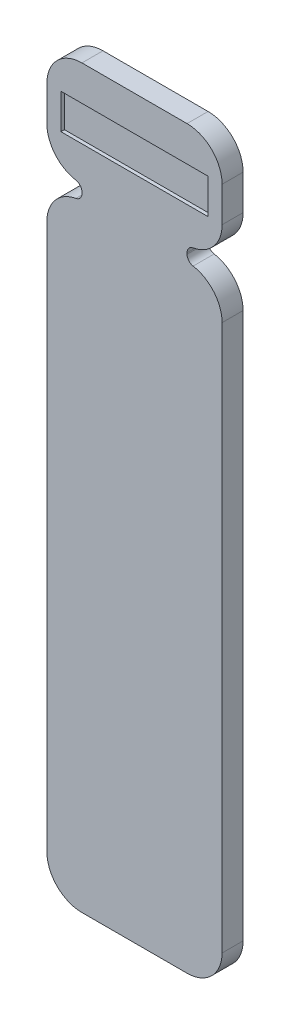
ISO-10303-21;
HEADER;
FILE_DESCRIPTION(('STEP AP214'),'2;1');
FILE_NAME('part.step','',(''),(''),'','','');
FILE_SCHEMA(('AUTOMOTIVE_DESIGN { 1 0 10303 214 1 1 1 1 }'));
ENDSEC;
DATA;
#1=APPLICATION_CONTEXT('core data for automotive mechanical design processes');
#2=APPLICATION_PROTOCOL_DEFINITION('international standard','automotive_design',2000,#1);
#3=PRODUCT_CONTEXT('',#1,'mechanical');
#4=PRODUCT('Part','Part','',(#3));
#5=PRODUCT_RELATED_PRODUCT_CATEGORY('part','',(#4));
#6=PRODUCT_DEFINITION_FORMATION('','',#4);
#7=PRODUCT_DEFINITION_CONTEXT('part definition',#1,'design');
#8=PRODUCT_DEFINITION('design','',#6,#7);
#9=PRODUCT_DEFINITION_SHAPE('','',#8);
#10=(LENGTH_UNIT() NAMED_UNIT(*) SI_UNIT(.MILLI.,.METRE.));
#11=(NAMED_UNIT(*) PLANE_ANGLE_UNIT() SI_UNIT($,.RADIAN.));
#12=(NAMED_UNIT(*) SI_UNIT($,.STERADIAN.) SOLID_ANGLE_UNIT());
#13=UNCERTAINTY_MEASURE_WITH_UNIT(LENGTH_MEASURE(1.E-05),#10,'distance_accuracy_value','');
#14=(GEOMETRIC_REPRESENTATION_CONTEXT(3) GLOBAL_UNCERTAINTY_ASSIGNED_CONTEXT((#13)) GLOBAL_UNIT_ASSIGNED_CONTEXT((#10,
#11,#12)) REPRESENTATION_CONTEXT('',''));
#15=CARTESIAN_POINT('',(0.,0.,0.));
#16=DIRECTION('',(0.,0.,1.));
#17=DIRECTION('',(1.,0.,0.));
#18=AXIS2_PLACEMENT_3D('',#15,#16,#17);
#19=CARTESIAN_POINT('',(-50.,35.,3.));
#20=DIRECTION('',(0.,-1.,0.));
#21=DIRECTION('',(1.,0.,0.));
#22=AXIS2_PLACEMENT_3D('',#19,#20,#21);
#23=PLANE('',#22);
#24=DIRECTION('',(-1.,0.,0.));
#25=VECTOR('',#24,1.);
#26=CARTESIAN_POINT('',(-50.,35.,3.));
#27=LINE('',#26,#25);
#28=CARTESIAN_POINT('',(-30.,35.,3.));
#29=VERTEX_POINT('',#28);
#30=CARTESIAN_POINT('',(-45.,35.,3.));
#31=VERTEX_POINT('',#30);
#32=EDGE_CURVE('E248',#29,#31,#27,.T.);
#33=ORIENTED_EDGE('',*,*,#32,.F.);
#34=DIRECTION('',(0.,0.,-1.));
#35=VECTOR('',#34,1.);
#36=CARTESIAN_POINT('',(-30.,35.,3.));
#37=LINE('',#36,#35);
#38=CARTESIAN_POINT('',(-30.,35.,0.));
#39=VERTEX_POINT('',#38);
#40=EDGE_CURVE('E341',#29,#39,#37,.T.);
#41=ORIENTED_EDGE('',*,*,#40,.T.);
#42=DIRECTION('',(-1.,0.,0.));
#43=VECTOR('',#42,1.);
#44=CARTESIAN_POINT('',(-50.,35.,0.));
#45=LINE('',#44,#43);
#46=CARTESIAN_POINT('',(-45.,35.,0.));
#47=VERTEX_POINT('',#46);
#48=EDGE_CURVE('E224',#39,#47,#45,.T.);
#49=ORIENTED_EDGE('',*,*,#48,.T.);
#50=DIRECTION('',(0.,0.,-1.));
#51=VECTOR('',#50,1.);
#52=CARTESIAN_POINT('',(-45.,35.,3.));
#53=LINE('',#52,#51);
#54=EDGE_CURVE('E339',#47,#31,#53,.F.);
#55=ORIENTED_EDGE('',*,*,#54,.T.);
#56=EDGE_LOOP('',(#33,#41,#49,#55));
#57=FACE_BOUND('',#56,.T.);
#58=ADVANCED_FACE('F26',(#57),#23,.F.);
#59=CARTESIAN_POINT('',(-50.,35.,3.));
#60=DIRECTION('',(1.,0.,0.));
#61=DIRECTION('',(0.,1.,0.));
#62=AXIS2_PLACEMENT_3D('',#59,#60,#61);
#63=PLANE('',#62);
#64=DIRECTION('',(0.,-1.,0.));
#65=VECTOR('',#64,1.);
#66=CARTESIAN_POINT('',(-50.,35.,3.));
#67=LINE('',#66,#65);
#68=CARTESIAN_POINT('',(-50.,30.,3.));
#69=VERTEX_POINT('',#68);
#70=CARTESIAN_POINT('',(-50.,25.,3.));
#71=VERTEX_POINT('',#70);
#72=EDGE_CURVE('E251',#69,#71,#67,.T.);
#73=ORIENTED_EDGE('',*,*,#72,.F.);
#74=DIRECTION('',(0.,0.,-1.));
#75=VECTOR('',#74,1.);
#76=CARTESIAN_POINT('',(-50.,30.,3.));
#77=LINE('',#76,#75);
#78=CARTESIAN_POINT('',(-50.,30.,0.));
#79=VERTEX_POINT('',#78);
#80=EDGE_CURVE('E11',#69,#79,#77,.T.);
#81=ORIENTED_EDGE('',*,*,#80,.T.);
#82=DIRECTION('',(0.,-1.,0.));
#83=VECTOR('',#82,1.);
#84=CARTESIAN_POINT('',(-50.,35.,0.));
#85=LINE('',#84,#83);
#86=CARTESIAN_POINT('',(-50.,25.,0.));
#87=VERTEX_POINT('',#86);
#88=EDGE_CURVE('E229',#79,#87,#85,.T.);
#89=ORIENTED_EDGE('',*,*,#88,.T.);
#90=DIRECTION('',(0.,0.,-1.));
#91=VECTOR('',#90,1.);
#92=CARTESIAN_POINT('',(-50.,25.,3.));
#93=LINE('',#92,#91);
#94=EDGE_CURVE('E300',#87,#71,#93,.F.);
#95=ORIENTED_EDGE('',*,*,#94,.T.);
#96=EDGE_LOOP('',(#73,#81,#89,#95));
#97=FACE_BOUND('',#96,.T.);
#98=ADVANCED_FACE('F418',(#97),#63,.F.);
#99=CARTESIAN_POINT('',(-45.,20.,3.));
#100=DIRECTION('',(1.,0.,0.));
#101=DIRECTION('',(0.,0.,-1.));
#102=AXIS2_PLACEMENT_3D('',#99,#100,#101);
#103=PLANE('',#102);
#104=DIRECTION('',(0.,-1.,0.));
#105=VECTOR('',#104,1.);
#106=CARTESIAN_POINT('',(-45.,20.,0.));
#107=LINE('',#106,#105);
#108=CARTESIAN_POINT('',(-45.,19.0418123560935,0.));
#109=VERTEX_POINT('',#108);
#110=CARTESIAN_POINT('',(-45.,18.8581876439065,0.));
#111=VERTEX_POINT('',#110);
#112=EDGE_CURVE('E231',#109,#111,#107,.T.);
#113=ORIENTED_EDGE('',*,*,#112,.T.);
#114=DIRECTION('',(0.,0.,-1.));
#115=VECTOR('',#114,1.);
#116=CARTESIAN_POINT('',(-45.,18.8581876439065,3.));
#117=LINE('',#116,#115);
#118=CARTESIAN_POINT('',(-45.,18.8581876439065,3.));
#119=VERTEX_POINT('',#118);
#120=EDGE_CURVE('E319',#111,#119,#117,.F.);
#121=ORIENTED_EDGE('',*,*,#120,.T.);
#122=DIRECTION('',(0.,-1.,0.));
#123=VECTOR('',#122,1.);
#124=CARTESIAN_POINT('',(-45.,20.,3.));
#125=LINE('',#124,#123);
#126=CARTESIAN_POINT('',(-45.,19.0418123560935,3.));
#127=VERTEX_POINT('',#126);
#128=EDGE_CURVE('E253',#127,#119,#125,.T.);
#129=ORIENTED_EDGE('',*,*,#128,.F.);
#130=DIRECTION('',(0.,0.,-1.));
#131=VECTOR('',#130,1.);
#132=CARTESIAN_POINT('',(-45.,19.0418123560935,3.));
#133=LINE('',#132,#131);
#134=EDGE_CURVE('E316',#127,#109,#133,.T.);
#135=ORIENTED_EDGE('',*,*,#134,.T.);
#136=EDGE_LOOP('',(#113,#121,#129,#135));
#137=FACE_BOUND('',#136,.T.);
#138=ADVANCED_FACE('F433',(#137),#103,.F.);
#139=CARTESIAN_POINT('',(-50.,17.9,3.));
#140=DIRECTION('',(1.,0.,0.));
#141=DIRECTION('',(0.,1.,0.));
#142=AXIS2_PLACEMENT_3D('',#139,#140,#141);
#143=PLANE('',#142);
#144=DIRECTION('',(0.,-1.,0.));
#145=VECTOR('',#144,1.);
#146=CARTESIAN_POINT('',(-50.,17.9,0.));
#147=LINE('',#146,#145);
#148=CARTESIAN_POINT('',(-50.,12.9,0.));
#149=VERTEX_POINT('',#148);
#150=CARTESIAN_POINT('',(-50.,-65.,0.));
#151=VERTEX_POINT('',#150);
#152=EDGE_CURVE('E234',#149,#151,#147,.T.);
#153=ORIENTED_EDGE('',*,*,#152,.T.);
#154=DIRECTION('',(0.,0.,-1.));
#155=VECTOR('',#154,1.);
#156=CARTESIAN_POINT('',(-50.,-65.,3.));
#157=LINE('',#156,#155);
#158=CARTESIAN_POINT('',(-50.,-65.,3.));
#159=VERTEX_POINT('',#158);
#160=EDGE_CURVE('E366',#151,#159,#157,.F.);
#161=ORIENTED_EDGE('',*,*,#160,.T.);
#162=DIRECTION('',(0.,-1.,0.));
#163=VECTOR('',#162,1.);
#164=CARTESIAN_POINT('',(-50.,17.9,3.));
#165=LINE('',#164,#163);
#166=CARTESIAN_POINT('',(-50.,12.9,3.));
#167=VERTEX_POINT('',#166);
#168=EDGE_CURVE('E256',#167,#159,#165,.T.);
#169=ORIENTED_EDGE('',*,*,#168,.F.);
#170=DIRECTION('',(0.,0.,-1.));
#171=VECTOR('',#170,1.);
#172=CARTESIAN_POINT('',(-50.,12.9,3.));
#173=LINE('',#172,#171);
#174=EDGE_CURVE('E297',#167,#149,#173,.T.);
#175=ORIENTED_EDGE('',*,*,#174,.T.);
#176=EDGE_LOOP('',(#153,#161,#169,#175));
#177=FACE_BOUND('',#176,.T.);
#178=ADVANCED_FACE('F447',(#177),#143,.F.);
#179=CARTESIAN_POINT('',(-50.,-70.,3.));
#180=DIRECTION('',(0.,1.,0.));
#181=DIRECTION('',(0.,0.,1.));
#182=AXIS2_PLACEMENT_3D('',#179,#180,#181);
#183=PLANE('',#182);
#184=DIRECTION('',(1.,0.,0.));
#185=VECTOR('',#184,1.);
#186=CARTESIAN_POINT('',(-50.,-70.,3.));
#187=LINE('',#186,#185);
#188=CARTESIAN_POINT('',(-45.,-70.,3.));
#189=VERTEX_POINT('',#188);
#190=CARTESIAN_POINT('',(-30.,-70.,3.));
#191=VERTEX_POINT('',#190);
#192=EDGE_CURVE('E259',#189,#191,#187,.T.);
#193=ORIENTED_EDGE('',*,*,#192,.F.);
#194=DIRECTION('',(0.,0.,-1.));
#195=VECTOR('',#194,1.);
#196=CARTESIAN_POINT('',(-45.,-70.,3.));
#197=LINE('',#196,#195);
#198=CARTESIAN_POINT('',(-45.,-70.,0.));
#199=VERTEX_POINT('',#198);
#200=EDGE_CURVE('E363',#189,#199,#197,.T.);
#201=ORIENTED_EDGE('',*,*,#200,.T.);
#202=DIRECTION('',(1.,0.,0.));
#203=VECTOR('',#202,1.);
#204=CARTESIAN_POINT('',(-50.,-70.,0.));
#205=LINE('',#204,#203);
#206=CARTESIAN_POINT('',(-30.,-70.,0.));
#207=VERTEX_POINT('',#206);
#208=EDGE_CURVE('E237',#199,#207,#205,.T.);
#209=ORIENTED_EDGE('',*,*,#208,.T.);
#210=DIRECTION('',(0.,0.,-1.));
#211=VECTOR('',#210,1.);
#212=CARTESIAN_POINT('',(-30.,-70.,3.));
#213=LINE('',#212,#211);
#214=EDGE_CURVE('E361',#207,#191,#213,.F.);
#215=ORIENTED_EDGE('',*,*,#214,.T.);
#216=EDGE_LOOP('',(#193,#201,#209,#215));
#217=FACE_BOUND('',#216,.T.);
#218=ADVANCED_FACE('F454',(#217),#183,.F.);
#219=CARTESIAN_POINT('',(-25.,17.9,3.));
#220=DIRECTION('',(-1.,0.,0.));
#221=DIRECTION('',(0.,-1.,0.));
#222=AXIS2_PLACEMENT_3D('',#219,#220,#221);
#223=PLANE('',#222);
#224=DIRECTION('',(0.,1.,0.));
#225=VECTOR('',#224,1.);
#226=CARTESIAN_POINT('',(-25.,17.9,3.));
#227=LINE('',#226,#225);
#228=CARTESIAN_POINT('',(-25.,-65.,3.));
#229=VERTEX_POINT('',#228);
#230=CARTESIAN_POINT('',(-25.,12.9,3.));
#231=VERTEX_POINT('',#230);
#232=EDGE_CURVE('E261',#229,#231,#227,.T.);
#233=ORIENTED_EDGE('',*,*,#232,.F.);
#234=DIRECTION('',(0.,0.,-1.));
#235=VECTOR('',#234,1.);
#236=CARTESIAN_POINT('',(-25.,-65.,3.));
#237=LINE('',#236,#235);
#238=CARTESIAN_POINT('',(-25.,-65.,0.));
#239=VERTEX_POINT('',#238);
#240=EDGE_CURVE('E33',#229,#239,#237,.T.);
#241=ORIENTED_EDGE('',*,*,#240,.T.);
#242=DIRECTION('',(0.,1.,0.));
#243=VECTOR('',#242,1.);
#244=CARTESIAN_POINT('',(-25.,17.9,0.));
#245=LINE('',#244,#243);
#246=CARTESIAN_POINT('',(-25.,12.9,0.));
#247=VERTEX_POINT('',#246);
#248=EDGE_CURVE('E240',#239,#247,#245,.T.);
#249=ORIENTED_EDGE('',*,*,#248,.T.);
#250=DIRECTION('',(0.,0.,-1.));
#251=VECTOR('',#250,1.);
#252=CARTESIAN_POINT('',(-25.,12.9,3.));
#253=LINE('',#252,#251);
#254=EDGE_CURVE('E294',#247,#231,#253,.F.);
#255=ORIENTED_EDGE('',*,*,#254,.T.);
#256=EDGE_LOOP('',(#233,#241,#249,#255));
#257=FACE_BOUND('',#256,.T.);
#258=ADVANCED_FACE('F371',(#257),#223,.F.);
#259=CARTESIAN_POINT('',(-30.,20.,3.));
#260=DIRECTION('',(-1.,0.,0.));
#261=DIRECTION('',(0.,0.,1.));
#262=AXIS2_PLACEMENT_3D('',#259,#260,#261);
#263=PLANE('',#262);
#264=DIRECTION('',(0.,1.,0.));
#265=VECTOR('',#264,1.);
#266=CARTESIAN_POINT('',(-30.,20.,3.));
#267=LINE('',#266,#265);
#268=CARTESIAN_POINT('',(-30.,18.8581876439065,3.));
#269=VERTEX_POINT('',#268);
#270=CARTESIAN_POINT('',(-30.,19.0418123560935,3.));
#271=VERTEX_POINT('',#270);
#272=EDGE_CURVE('E263',#269,#271,#267,.T.);
#273=ORIENTED_EDGE('',*,*,#272,.F.);
#274=DIRECTION('',(0.,0.,-1.));
#275=VECTOR('',#274,1.);
#276=CARTESIAN_POINT('',(-30.,18.8581876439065,3.));
#277=LINE('',#276,#275);
#278=CARTESIAN_POINT('',(-30.,18.8581876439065,0.));
#279=VERTEX_POINT('',#278);
#280=EDGE_CURVE('E305',#269,#279,#277,.T.);
#281=ORIENTED_EDGE('',*,*,#280,.T.);
#282=DIRECTION('',(0.,1.,0.));
#283=VECTOR('',#282,1.);
#284=CARTESIAN_POINT('',(-30.,20.,0.));
#285=LINE('',#284,#283);
#286=CARTESIAN_POINT('',(-30.,19.0418123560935,0.));
#287=VERTEX_POINT('',#286);
#288=EDGE_CURVE('E242',#279,#287,#285,.T.);
#289=ORIENTED_EDGE('',*,*,#288,.T.);
#290=DIRECTION('',(0.,0.,-1.));
#291=VECTOR('',#290,1.);
#292=CARTESIAN_POINT('',(-30.,19.0418123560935,3.));
#293=LINE('',#292,#291);
#294=EDGE_CURVE('E303',#287,#271,#293,.F.);
#295=ORIENTED_EDGE('',*,*,#294,.T.);
#296=EDGE_LOOP('',(#273,#281,#289,#295));
#297=FACE_BOUND('',#296,.T.);
#298=ADVANCED_FACE('F390',(#297),#263,.F.);
#299=CARTESIAN_POINT('',(-25.,35.,3.));
#300=DIRECTION('',(-1.,0.,0.));
#301=DIRECTION('',(0.,-1.,0.));
#302=AXIS2_PLACEMENT_3D('',#299,#300,#301);
#303=PLANE('',#302);
#304=DIRECTION('',(0.,1.,0.));
#305=VECTOR('',#304,1.);
#306=CARTESIAN_POINT('',(-25.,35.,0.));
#307=LINE('',#306,#305);
#308=CARTESIAN_POINT('',(-25.,25.,0.));
#309=VERTEX_POINT('',#308);
#310=CARTESIAN_POINT('',(-25.,30.,0.));
#311=VERTEX_POINT('',#310);
#312=EDGE_CURVE('E245',#309,#311,#307,.T.);
#313=ORIENTED_EDGE('',*,*,#312,.T.);
#314=DIRECTION('',(0.,0.,-1.));
#315=VECTOR('',#314,1.);
#316=CARTESIAN_POINT('',(-25.,30.,3.));
#317=LINE('',#316,#315);
#318=CARTESIAN_POINT('',(-25.,30.,3.));
#319=VERTEX_POINT('',#318);
#320=EDGE_CURVE('E352',#311,#319,#317,.F.);
#321=ORIENTED_EDGE('',*,*,#320,.T.);
#322=DIRECTION('',(0.,1.,0.));
#323=VECTOR('',#322,1.);
#324=CARTESIAN_POINT('',(-25.,35.,3.));
#325=LINE('',#324,#323);
#326=CARTESIAN_POINT('',(-25.,25.,3.));
#327=VERTEX_POINT('',#326);
#328=EDGE_CURVE('E266',#327,#319,#325,.T.);
#329=ORIENTED_EDGE('',*,*,#328,.F.);
#330=DIRECTION('',(0.,0.,-1.));
#331=VECTOR('',#330,1.);
#332=CARTESIAN_POINT('',(-25.,25.,3.));
#333=LINE('',#332,#331);
#334=EDGE_CURVE('E269',#327,#309,#333,.T.);
#335=ORIENTED_EDGE('',*,*,#334,.T.);
#336=EDGE_LOOP('',(#313,#321,#329,#335));
#337=FACE_BOUND('',#336,.T.);
#338=ADVANCED_FACE('F404',(#337),#303,.F.);
#339=CARTESIAN_POINT('',(-25.,35.,3.));
#340=DIRECTION('',(0.,0.,-1.));
#341=DIRECTION('',(-1.,0.,0.));
#342=AXIS2_PLACEMENT_3D('',#339,#340,#341);
#343=PLANE('',#342);
#344=DIRECTION('',(1.,0.,0.));
#345=VECTOR('',#344,1.);
#346=CARTESIAN_POINT('',(-48.,25.,3.));
#347=LINE('',#346,#345);
#348=CARTESIAN_POINT('',(-48.,25.,3.));
#349=VERTEX_POINT('',#348);
#350=CARTESIAN_POINT('',(-27.,25.,3.));
#351=VERTEX_POINT('',#350);
#352=EDGE_CURVE('E202',#349,#351,#347,.T.);
#353=ORIENTED_EDGE('',*,*,#352,.F.);
#354=DIRECTION('',(0.,-1.,0.));
#355=VECTOR('',#354,1.);
#356=CARTESIAN_POINT('',(-48.,30.,3.));
#357=LINE('',#356,#355);
#358=CARTESIAN_POINT('',(-48.,30.,3.));
#359=VERTEX_POINT('',#358);
#360=EDGE_CURVE('E40',#359,#349,#357,.T.);
#361=ORIENTED_EDGE('',*,*,#360,.F.);
#362=DIRECTION('',(-1.,0.,0.));
#363=VECTOR('',#362,1.);
#364=CARTESIAN_POINT('',(-48.,30.,3.));
#365=LINE('',#364,#363);
#366=CARTESIAN_POINT('',(-27.,30.,3.));
#367=VERTEX_POINT('',#366);
#368=EDGE_CURVE('E208',#367,#359,#365,.T.);
#369=ORIENTED_EDGE('',*,*,#368,.F.);
#370=DIRECTION('',(0.,1.,0.));
#371=VECTOR('',#370,1.);
#372=CARTESIAN_POINT('',(-27.,30.,3.));
#373=LINE('',#372,#371);
#374=EDGE_CURVE('E191',#351,#367,#373,.T.);
#375=ORIENTED_EDGE('',*,*,#374,.F.);
#376=EDGE_LOOP('',(#353,#361,#369,#375));
#377=FACE_BOUND('',#376,.T.);
#378=ORIENTED_EDGE('',*,*,#328,.T.);
#379=CARTESIAN_POINT('',(-30.,30.,3.));
#380=DIRECTION('',(0.,0.,-1.));
#381=DIRECTION('',(-1.,0.,0.));
#382=AXIS2_PLACEMENT_3D('',#379,#380,#381);
#383=CIRCLE('',#382,5.);
#384=EDGE_CURVE('E359',#319,#29,#383,.F.);
#385=ORIENTED_EDGE('',*,*,#384,.T.);
#386=ORIENTED_EDGE('',*,*,#32,.T.);
#387=CARTESIAN_POINT('',(-45.,30.,3.));
#388=DIRECTION('',(0.,0.,-1.));
#389=DIRECTION('',(-1.,0.,0.));
#390=AXIS2_PLACEMENT_3D('',#387,#388,#389);
#391=CIRCLE('',#390,5.);
#392=EDGE_CURVE('E354',#31,#69,#391,.F.);
#393=ORIENTED_EDGE('',*,*,#392,.T.);
#394=ORIENTED_EDGE('',*,*,#72,.T.);
#395=CARTESIAN_POINT('',(-45.,25.,3.));
#396=DIRECTION('',(0.,0.,-1.));
#397=DIRECTION('',(-1.,0.,0.));
#398=AXIS2_PLACEMENT_3D('',#395,#396,#397);
#399=CIRCLE('',#398,5.);
#400=CARTESIAN_POINT('',(-45.8677685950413,20.0758779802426,3.));
#401=VERTEX_POINT('',#400);
#402=EDGE_CURVE('E284',#71,#401,#399,.F.);
#403=ORIENTED_EDGE('',*,*,#402,.T.);
#404=CARTESIAN_POINT('',(-46.05,19.0418123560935,3.));
#405=DIRECTION('',(0.,0.,-1.));
#406=DIRECTION('',(-1.,0.,0.));
#407=AXIS2_PLACEMENT_3D('',#404,#405,#406);
#408=CIRCLE('',#407,1.05);
#409=EDGE_CURVE('E337',#401,#127,#408,.T.);
#410=ORIENTED_EDGE('',*,*,#409,.T.);
#411=ORIENTED_EDGE('',*,*,#128,.T.);
#412=CARTESIAN_POINT('',(-46.05,18.8581876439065,3.));
#413=DIRECTION('',(0.,0.,-1.));
#414=DIRECTION('',(-1.,0.,0.));
#415=AXIS2_PLACEMENT_3D('',#412,#413,#414);
#416=CIRCLE('',#415,1.05);
#417=CARTESIAN_POINT('',(-45.8677685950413,17.8241220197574,3.));
#418=VERTEX_POINT('',#417);
#419=EDGE_CURVE('E333',#119,#418,#416,.T.);
#420=ORIENTED_EDGE('',*,*,#419,.T.);
#421=CARTESIAN_POINT('',(-45.,12.9,3.));
#422=DIRECTION('',(0.,0.,-1.));
#423=DIRECTION('',(-1.,0.,0.));
#424=AXIS2_PLACEMENT_3D('',#421,#422,#423);
#425=CIRCLE('',#424,5.);
#426=EDGE_CURVE('E287',#418,#167,#425,.F.);
#427=ORIENTED_EDGE('',*,*,#426,.T.);
#428=ORIENTED_EDGE('',*,*,#168,.T.);
#429=CARTESIAN_POINT('',(-45.,-65.,3.));
#430=DIRECTION('',(0.,0.,-1.));
#431=DIRECTION('',(-1.,0.,0.));
#432=AXIS2_PLACEMENT_3D('',#429,#430,#431);
#433=CIRCLE('',#432,5.);
#434=EDGE_CURVE('E357',#159,#189,#433,.F.);
#435=ORIENTED_EDGE('',*,*,#434,.T.);
#436=ORIENTED_EDGE('',*,*,#192,.T.);
#437=CARTESIAN_POINT('',(-30.,-65.,3.));
#438=DIRECTION('',(0.,0.,-1.));
#439=DIRECTION('',(-1.,0.,0.));
#440=AXIS2_PLACEMENT_3D('',#437,#438,#439);
#441=CIRCLE('',#440,5.);
#442=EDGE_CURVE('E48',#191,#229,#441,.F.);
#443=ORIENTED_EDGE('',*,*,#442,.T.);
#444=ORIENTED_EDGE('',*,*,#232,.T.);
#445=CARTESIAN_POINT('',(-30.,12.9,3.));
#446=DIRECTION('',(0.,0.,-1.));
#447=DIRECTION('',(-1.,0.,0.));
#448=AXIS2_PLACEMENT_3D('',#445,#446,#447);
#449=CIRCLE('',#448,5.);
#450=CARTESIAN_POINT('',(-29.1322314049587,17.8241220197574,3.));
#451=VERTEX_POINT('',#450);
#452=EDGE_CURVE('E289',#231,#451,#449,.F.);
#453=ORIENTED_EDGE('',*,*,#452,.T.);
#454=CARTESIAN_POINT('',(-28.95,18.8581876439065,3.));
#455=DIRECTION('',(0.,0.,-1.));
#456=DIRECTION('',(-1.,0.,0.));
#457=AXIS2_PLACEMENT_3D('',#454,#455,#456);
#458=CIRCLE('',#457,1.05);
#459=EDGE_CURVE('E325',#451,#269,#458,.T.);
#460=ORIENTED_EDGE('',*,*,#459,.T.);
#461=ORIENTED_EDGE('',*,*,#272,.T.);
#462=CARTESIAN_POINT('',(-28.95,19.0418123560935,3.));
#463=DIRECTION('',(0.,0.,-1.));
#464=DIRECTION('',(-1.,0.,0.));
#465=AXIS2_PLACEMENT_3D('',#462,#463,#464);
#466=CIRCLE('',#465,1.05);
#467=CARTESIAN_POINT('',(-29.1322314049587,20.0758779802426,3.));
#468=VERTEX_POINT('',#467);
#469=EDGE_CURVE('E329',#271,#468,#466,.T.);
#470=ORIENTED_EDGE('',*,*,#469,.T.);
#471=CARTESIAN_POINT('',(-30.,25.,3.));
#472=DIRECTION('',(0.,0.,-1.));
#473=DIRECTION('',(-1.,0.,0.));
#474=AXIS2_PLACEMENT_3D('',#471,#472,#473);
#475=CIRCLE('',#474,5.);
#476=EDGE_CURVE('E292',#468,#327,#475,.F.);
#477=ORIENTED_EDGE('',*,*,#476,.T.);
#478=EDGE_LOOP('',(#378,#385,#386,#393,#394,#403,#410,#411,#420,#427,#428,#435,#436,#443,#444,
#453,#460,#461,#470,#477));
#479=FACE_BOUND('',#478,.T.);
#480=ADVANCED_FACE('F206',(#377,#479),#343,.F.);
#481=CARTESIAN_POINT('',(-25.,35.,0.));
#482=DIRECTION('',(0.,0.,-1.));
#483=DIRECTION('',(-1.,0.,0.));
#484=AXIS2_PLACEMENT_3D('',#481,#482,#483);
#485=PLANE('',#484);
#486=ORIENTED_EDGE('',*,*,#48,.F.);
#487=CARTESIAN_POINT('',(-30.,30.,0.));
#488=DIRECTION('',(0.,0.,-1.));
#489=DIRECTION('',(-1.,0.,0.));
#490=AXIS2_PLACEMENT_3D('',#487,#488,#489);
#491=CIRCLE('',#490,5.);
#492=EDGE_CURVE('E350',#39,#311,#491,.T.);
#493=ORIENTED_EDGE('',*,*,#492,.T.);
#494=ORIENTED_EDGE('',*,*,#312,.F.);
#495=CARTESIAN_POINT('',(-30.,25.,0.));
#496=DIRECTION('',(0.,0.,-1.));
#497=DIRECTION('',(-1.,0.,0.));
#498=AXIS2_PLACEMENT_3D('',#495,#496,#497);
#499=CIRCLE('',#498,5.);
#500=CARTESIAN_POINT('',(-29.1322314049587,20.0758779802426,0.));
#501=VERTEX_POINT('',#500);
#502=EDGE_CURVE('E281',#309,#501,#499,.T.);
#503=ORIENTED_EDGE('',*,*,#502,.T.);
#504=CARTESIAN_POINT('',(-28.95,19.0418123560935,0.));
#505=DIRECTION('',(0.,0.,-1.));
#506=DIRECTION('',(-1.,0.,0.));
#507=AXIS2_PLACEMENT_3D('',#504,#505,#506);
#508=CIRCLE('',#507,1.05);
#509=EDGE_CURVE('E327',#501,#287,#508,.F.);
#510=ORIENTED_EDGE('',*,*,#509,.T.);
#511=ORIENTED_EDGE('',*,*,#288,.F.);
#512=CARTESIAN_POINT('',(-28.95,18.8581876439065,0.));
#513=DIRECTION('',(0.,0.,-1.));
#514=DIRECTION('',(-1.,0.,0.));
#515=AXIS2_PLACEMENT_3D('',#512,#513,#514);
#516=CIRCLE('',#515,1.05);
#517=CARTESIAN_POINT('',(-29.1322314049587,17.8241220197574,0.));
#518=VERTEX_POINT('',#517);
#519=EDGE_CURVE('E323',#279,#518,#516,.F.);
#520=ORIENTED_EDGE('',*,*,#519,.T.);
#521=CARTESIAN_POINT('',(-30.,12.9,0.));
#522=DIRECTION('',(0.,0.,-1.));
#523=DIRECTION('',(-1.,0.,0.));
#524=AXIS2_PLACEMENT_3D('',#521,#522,#523);
#525=CIRCLE('',#524,5.);
#526=EDGE_CURVE('E278',#518,#247,#525,.T.);
#527=ORIENTED_EDGE('',*,*,#526,.T.);
#528=ORIENTED_EDGE('',*,*,#248,.F.);
#529=CARTESIAN_POINT('',(-30.,-65.,0.));
#530=DIRECTION('',(0.,0.,-1.));
#531=DIRECTION('',(-1.,0.,0.));
#532=AXIS2_PLACEMENT_3D('',#529,#530,#531);
#533=CIRCLE('',#532,5.);
#534=EDGE_CURVE('E346',#239,#207,#533,.T.);
#535=ORIENTED_EDGE('',*,*,#534,.T.);
#536=ORIENTED_EDGE('',*,*,#208,.F.);
#537=CARTESIAN_POINT('',(-45.,-65.,0.));
#538=DIRECTION('',(0.,0.,-1.));
#539=DIRECTION('',(-1.,0.,0.));
#540=AXIS2_PLACEMENT_3D('',#537,#538,#539);
#541=CIRCLE('',#540,5.);
#542=EDGE_CURVE('E348',#199,#151,#541,.T.);
#543=ORIENTED_EDGE('',*,*,#542,.T.);
#544=ORIENTED_EDGE('',*,*,#152,.F.);
#545=CARTESIAN_POINT('',(-45.,12.9,0.));
#546=DIRECTION('',(0.,0.,-1.));
#547=DIRECTION('',(-1.,0.,0.));
#548=AXIS2_PLACEMENT_3D('',#545,#546,#547);
#549=CIRCLE('',#548,5.);
#550=CARTESIAN_POINT('',(-45.8677685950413,17.8241220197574,0.));
#551=VERTEX_POINT('',#550);
#552=EDGE_CURVE('E275',#149,#551,#549,.T.);
#553=ORIENTED_EDGE('',*,*,#552,.T.);
#554=CARTESIAN_POINT('',(-46.05,18.8581876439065,0.));
#555=DIRECTION('',(0.,0.,-1.));
#556=DIRECTION('',(-1.,0.,0.));
#557=AXIS2_PLACEMENT_3D('',#554,#555,#556);
#558=CIRCLE('',#557,1.05);
#559=EDGE_CURVE('E331',#551,#111,#558,.F.);
#560=ORIENTED_EDGE('',*,*,#559,.T.);
#561=ORIENTED_EDGE('',*,*,#112,.F.);
#562=CARTESIAN_POINT('',(-46.05,19.0418123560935,0.));
#563=DIRECTION('',(0.,0.,-1.));
#564=DIRECTION('',(-1.,0.,0.));
#565=AXIS2_PLACEMENT_3D('',#562,#563,#564);
#566=CIRCLE('',#565,1.05);
#567=CARTESIAN_POINT('',(-45.8677685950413,20.0758779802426,0.));
#568=VERTEX_POINT('',#567);
#569=EDGE_CURVE('E335',#109,#568,#566,.F.);
#570=ORIENTED_EDGE('',*,*,#569,.T.);
#571=CARTESIAN_POINT('',(-45.,25.,0.));
#572=DIRECTION('',(0.,0.,-1.));
#573=DIRECTION('',(-1.,0.,0.));
#574=AXIS2_PLACEMENT_3D('',#571,#572,#573);
#575=CIRCLE('',#574,5.);
#576=EDGE_CURVE('E272',#568,#87,#575,.T.);
#577=ORIENTED_EDGE('',*,*,#576,.T.);
#578=ORIENTED_EDGE('',*,*,#88,.F.);
#579=CARTESIAN_POINT('',(-45.,30.,0.));
#580=DIRECTION('',(0.,0.,-1.));
#581=DIRECTION('',(-1.,0.,0.));
#582=AXIS2_PLACEMENT_3D('',#579,#580,#581);
#583=CIRCLE('',#582,5.);
#584=EDGE_CURVE('E344',#79,#47,#583,.T.);
#585=ORIENTED_EDGE('',*,*,#584,.T.);
#586=EDGE_LOOP('',(#486,#493,#494,#503,#510,#511,#520,#527,#528,#535,#536,#543,#544,#553,#560,
#561,#570,#577,#578,#585));
#587=FACE_BOUND('',#586,.T.);
#588=ADVANCED_FACE('F375',(#587),#485,.T.);
#589=CARTESIAN_POINT('',(-30.,25.,3.));
#590=DIRECTION('',(0.,0.,-1.));
#591=DIRECTION('',(-1.,0.,0.));
#592=AXIS2_PLACEMENT_3D('',#589,#590,#591);
#593=CYLINDRICAL_SURFACE('',#592,5.);
#594=ORIENTED_EDGE('',*,*,#476,.F.);
#595=DIRECTION('',(0.,0.,-1.));
#596=VECTOR('',#595,1.);
#597=CARTESIAN_POINT('',(-29.1322314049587,20.0758779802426,3.));
#598=LINE('',#597,#596);
#599=EDGE_CURVE('E310',#468,#501,#598,.T.);
#600=ORIENTED_EDGE('',*,*,#599,.T.);
#601=ORIENTED_EDGE('',*,*,#502,.F.);
#602=ORIENTED_EDGE('',*,*,#334,.F.);
#603=EDGE_LOOP('',(#594,#600,#601,#602));
#604=FACE_BOUND('',#603,.T.);
#605=ADVANCED_FACE('F399',(#604),#593,.T.);
#606=CARTESIAN_POINT('',(-30.,12.9,3.));
#607=DIRECTION('',(0.,0.,-1.));
#608=DIRECTION('',(-1.,0.,0.));
#609=AXIS2_PLACEMENT_3D('',#606,#607,#608);
#610=CYLINDRICAL_SURFACE('',#609,5.);
#611=ORIENTED_EDGE('',*,*,#526,.F.);
#612=DIRECTION('',(0.,0.,-1.));
#613=VECTOR('',#612,1.);
#614=CARTESIAN_POINT('',(-29.1322314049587,17.8241220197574,3.));
#615=LINE('',#614,#613);
#616=EDGE_CURVE('E308',#518,#451,#615,.F.);
#617=ORIENTED_EDGE('',*,*,#616,.T.);
#618=ORIENTED_EDGE('',*,*,#452,.F.);
#619=ORIENTED_EDGE('',*,*,#254,.F.);
#620=EDGE_LOOP('',(#611,#617,#618,#619));
#621=FACE_BOUND('',#620,.T.);
#622=ADVANCED_FACE('F383',(#621),#610,.T.);
#623=CARTESIAN_POINT('',(-45.,12.9,3.));
#624=DIRECTION('',(0.,0.,-1.));
#625=DIRECTION('',(-1.,0.,0.));
#626=AXIS2_PLACEMENT_3D('',#623,#624,#625);
#627=CYLINDRICAL_SURFACE('',#626,5.);
#628=ORIENTED_EDGE('',*,*,#426,.F.);
#629=DIRECTION('',(0.,0.,-1.));
#630=VECTOR('',#629,1.);
#631=CARTESIAN_POINT('',(-45.8677685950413,17.8241220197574,3.));
#632=LINE('',#631,#630);
#633=EDGE_CURVE('E313',#418,#551,#632,.T.);
#634=ORIENTED_EDGE('',*,*,#633,.T.);
#635=ORIENTED_EDGE('',*,*,#552,.F.);
#636=ORIENTED_EDGE('',*,*,#174,.F.);
#637=EDGE_LOOP('',(#628,#634,#635,#636));
#638=FACE_BOUND('',#637,.T.);
#639=ADVANCED_FACE('F442',(#638),#627,.T.);
#640=CARTESIAN_POINT('',(-45.,25.,3.));
#641=DIRECTION('',(0.,0.,-1.));
#642=DIRECTION('',(-1.,0.,0.));
#643=AXIS2_PLACEMENT_3D('',#640,#641,#642);
#644=CYLINDRICAL_SURFACE('',#643,5.);
#645=ORIENTED_EDGE('',*,*,#576,.F.);
#646=DIRECTION('',(0.,0.,-1.));
#647=VECTOR('',#646,1.);
#648=CARTESIAN_POINT('',(-45.8677685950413,20.0758779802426,3.));
#649=LINE('',#648,#647);
#650=EDGE_CURVE('E321',#568,#401,#649,.F.);
#651=ORIENTED_EDGE('',*,*,#650,.T.);
#652=ORIENTED_EDGE('',*,*,#402,.F.);
#653=ORIENTED_EDGE('',*,*,#94,.F.);
#654=EDGE_LOOP('',(#645,#651,#652,#653));
#655=FACE_BOUND('',#654,.T.);
#656=ADVANCED_FACE('F424',(#655),#644,.T.);
#657=CARTESIAN_POINT('',(-28.95,18.8581876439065,3.));
#658=DIRECTION('',(0.,0.,-1.));
#659=DIRECTION('',(-1.,0.,0.));
#660=AXIS2_PLACEMENT_3D('',#657,#658,#659);
#661=CYLINDRICAL_SURFACE('',#660,1.05);
#662=ORIENTED_EDGE('',*,*,#459,.F.);
#663=ORIENTED_EDGE('',*,*,#616,.F.);
#664=ORIENTED_EDGE('',*,*,#519,.F.);
#665=ORIENTED_EDGE('',*,*,#280,.F.);
#666=EDGE_LOOP('',(#662,#663,#664,#665));
#667=FACE_BOUND('',#666,.T.);
#668=ADVANCED_FACE('F388',(#667),#661,.F.);
#669=CARTESIAN_POINT('',(-28.95,19.0418123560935,3.));
#670=DIRECTION('',(0.,0.,-1.));
#671=DIRECTION('',(-1.,0.,0.));
#672=AXIS2_PLACEMENT_3D('',#669,#670,#671);
#673=CYLINDRICAL_SURFACE('',#672,1.05);
#674=ORIENTED_EDGE('',*,*,#469,.F.);
#675=ORIENTED_EDGE('',*,*,#294,.F.);
#676=ORIENTED_EDGE('',*,*,#509,.F.);
#677=ORIENTED_EDGE('',*,*,#599,.F.);
#678=EDGE_LOOP('',(#674,#675,#676,#677));
#679=FACE_BOUND('',#678,.T.);
#680=ADVANCED_FACE('F396',(#679),#673,.F.);
#681=CARTESIAN_POINT('',(-46.05,18.8581876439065,3.));
#682=DIRECTION('',(0.,0.,-1.));
#683=DIRECTION('',(-1.,0.,0.));
#684=AXIS2_PLACEMENT_3D('',#681,#682,#683);
#685=CYLINDRICAL_SURFACE('',#684,1.05);
#686=ORIENTED_EDGE('',*,*,#419,.F.);
#687=ORIENTED_EDGE('',*,*,#120,.F.);
#688=ORIENTED_EDGE('',*,*,#559,.F.);
#689=ORIENTED_EDGE('',*,*,#633,.F.);
#690=EDGE_LOOP('',(#686,#687,#688,#689));
#691=FACE_BOUND('',#690,.T.);
#692=ADVANCED_FACE('F439',(#691),#685,.F.);
#693=CARTESIAN_POINT('',(-46.05,19.0418123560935,3.));
#694=DIRECTION('',(0.,0.,-1.));
#695=DIRECTION('',(-1.,0.,0.));
#696=AXIS2_PLACEMENT_3D('',#693,#694,#695);
#697=CYLINDRICAL_SURFACE('',#696,1.05);
#698=ORIENTED_EDGE('',*,*,#409,.F.);
#699=ORIENTED_EDGE('',*,*,#650,.F.);
#700=ORIENTED_EDGE('',*,*,#569,.F.);
#701=ORIENTED_EDGE('',*,*,#134,.F.);
#702=EDGE_LOOP('',(#698,#699,#700,#701));
#703=FACE_BOUND('',#702,.T.);
#704=ADVANCED_FACE('F430',(#703),#697,.F.);
#705=CARTESIAN_POINT('',(-30.,30.,3.));
#706=DIRECTION('',(0.,0.,-1.));
#707=DIRECTION('',(-1.,0.,0.));
#708=AXIS2_PLACEMENT_3D('',#705,#706,#707);
#709=CYLINDRICAL_SURFACE('',#708,5.);
#710=ORIENTED_EDGE('',*,*,#384,.F.);
#711=ORIENTED_EDGE('',*,*,#320,.F.);
#712=ORIENTED_EDGE('',*,*,#492,.F.);
#713=ORIENTED_EDGE('',*,*,#40,.F.);
#714=EDGE_LOOP('',(#710,#711,#712,#713));
#715=FACE_BOUND('',#714,.T.);
#716=ADVANCED_FACE('F407',(#715),#709,.T.);
#717=CARTESIAN_POINT('',(-45.,-65.,3.));
#718=DIRECTION('',(0.,0.,-1.));
#719=DIRECTION('',(-1.,0.,0.));
#720=AXIS2_PLACEMENT_3D('',#717,#718,#719);
#721=CYLINDRICAL_SURFACE('',#720,5.);
#722=ORIENTED_EDGE('',*,*,#434,.F.);
#723=ORIENTED_EDGE('',*,*,#160,.F.);
#724=ORIENTED_EDGE('',*,*,#542,.F.);
#725=ORIENTED_EDGE('',*,*,#200,.F.);
#726=EDGE_LOOP('',(#722,#723,#724,#725));
#727=FACE_BOUND('',#726,.T.);
#728=ADVANCED_FACE('F450',(#727),#721,.T.);
#729=CARTESIAN_POINT('',(-30.,-65.,3.));
#730=DIRECTION('',(0.,0.,-1.));
#731=DIRECTION('',(-1.,0.,0.));
#732=AXIS2_PLACEMENT_3D('',#729,#730,#731);
#733=CYLINDRICAL_SURFACE('',#732,5.);
#734=ORIENTED_EDGE('',*,*,#442,.F.);
#735=ORIENTED_EDGE('',*,*,#214,.F.);
#736=ORIENTED_EDGE('',*,*,#534,.F.);
#737=ORIENTED_EDGE('',*,*,#240,.F.);
#738=EDGE_LOOP('',(#734,#735,#736,#737));
#739=FACE_BOUND('',#738,.T.);
#740=ADVANCED_FACE('F456',(#739),#733,.T.);
#741=CARTESIAN_POINT('',(-45.,30.,3.));
#742=DIRECTION('',(0.,0.,-1.));
#743=DIRECTION('',(-1.,0.,0.));
#744=AXIS2_PLACEMENT_3D('',#741,#742,#743);
#745=CYLINDRICAL_SURFACE('',#744,5.);
#746=ORIENTED_EDGE('',*,*,#392,.F.);
#747=ORIENTED_EDGE('',*,*,#54,.F.);
#748=ORIENTED_EDGE('',*,*,#584,.F.);
#749=ORIENTED_EDGE('',*,*,#80,.F.);
#750=EDGE_LOOP('',(#746,#747,#748,#749));
#751=FACE_BOUND('',#750,.T.);
#752=ADVANCED_FACE('F414',(#751),#745,.T.);
#753=CARTESIAN_POINT('',(-48.,30.,2.5));
#754=DIRECTION('',(-1.,0.,0.));
#755=DIRECTION('',(0.,0.,1.));
#756=AXIS2_PLACEMENT_3D('',#753,#754,#755);
#757=PLANE('',#756);
#758=ORIENTED_EDGE('',*,*,#360,.T.);
#759=DIRECTION('',(0.,0.,1.));
#760=VECTOR('',#759,1.);
#761=CARTESIAN_POINT('',(-48.,25.,2.5));
#762=LINE('',#761,#760);
#763=CARTESIAN_POINT('',(-48.,25.,2.5));
#764=VERTEX_POINT('',#763);
#765=EDGE_CURVE('E199',#764,#349,#762,.T.);
#766=ORIENTED_EDGE('',*,*,#765,.F.);
#767=DIRECTION('',(0.,-1.,0.));
#768=VECTOR('',#767,1.);
#769=CARTESIAN_POINT('',(-48.,30.,2.5));
#770=LINE('',#769,#768);
#771=CARTESIAN_POINT('',(-48.,30.,2.5));
#772=VERTEX_POINT('',#771);
#773=EDGE_CURVE('E210',#772,#764,#770,.T.);
#774=ORIENTED_EDGE('',*,*,#773,.F.);
#775=DIRECTION('',(0.,0.,1.));
#776=VECTOR('',#775,1.);
#777=CARTESIAN_POINT('',(-48.,30.,2.5));
#778=LINE('',#777,#776);
#779=EDGE_CURVE('E222',#772,#359,#778,.T.);
#780=ORIENTED_EDGE('',*,*,#779,.T.);
#781=EDGE_LOOP('',(#758,#766,#774,#780));
#782=FACE_BOUND('',#781,.T.);
#783=ADVANCED_FACE('F463',(#782),#757,.F.);
#784=CARTESIAN_POINT('',(-48.,30.,2.5));
#785=DIRECTION('',(0.,1.,0.));
#786=DIRECTION('',(0.,0.,1.));
#787=AXIS2_PLACEMENT_3D('',#784,#785,#786);
#788=PLANE('',#787);
#789=ORIENTED_EDGE('',*,*,#368,.T.);
#790=ORIENTED_EDGE('',*,*,#779,.F.);
#791=DIRECTION('',(-1.,0.,0.));
#792=VECTOR('',#791,1.);
#793=CARTESIAN_POINT('',(-48.,30.,2.5));
#794=LINE('',#793,#792);
#795=CARTESIAN_POINT('',(-27.,30.,2.5));
#796=VERTEX_POINT('',#795);
#797=EDGE_CURVE('E219',#796,#772,#794,.T.);
#798=ORIENTED_EDGE('',*,*,#797,.F.);
#799=DIRECTION('',(0.,0.,1.));
#800=VECTOR('',#799,1.);
#801=CARTESIAN_POINT('',(-27.,30.,2.5));
#802=LINE('',#801,#800);
#803=EDGE_CURVE('E198',#796,#367,#802,.T.);
#804=ORIENTED_EDGE('',*,*,#803,.T.);
#805=EDGE_LOOP('',(#789,#790,#798,#804));
#806=FACE_BOUND('',#805,.T.);
#807=ADVANCED_FACE('F528',(#806),#788,.F.);
#808=CARTESIAN_POINT('',(-27.,30.,2.5));
#809=DIRECTION('',(1.,0.,0.));
#810=DIRECTION('',(0.,0.,-1.));
#811=AXIS2_PLACEMENT_3D('',#808,#809,#810);
#812=PLANE('',#811);
#813=ORIENTED_EDGE('',*,*,#374,.T.);
#814=ORIENTED_EDGE('',*,*,#803,.F.);
#815=DIRECTION('',(0.,1.,0.));
#816=VECTOR('',#815,1.);
#817=CARTESIAN_POINT('',(-27.,30.,2.5));
#818=LINE('',#817,#816);
#819=CARTESIAN_POINT('',(-27.,25.,2.5));
#820=VERTEX_POINT('',#819);
#821=EDGE_CURVE('E194',#820,#796,#818,.T.);
#822=ORIENTED_EDGE('',*,*,#821,.F.);
#823=DIRECTION('',(0.,0.,1.));
#824=VECTOR('',#823,1.);
#825=CARTESIAN_POINT('',(-27.,25.,2.5));
#826=LINE('',#825,#824);
#827=EDGE_CURVE('E187',#820,#351,#826,.T.);
#828=ORIENTED_EDGE('',*,*,#827,.T.);
#829=EDGE_LOOP('',(#813,#814,#822,#828));
#830=FACE_BOUND('',#829,.T.);
#831=ADVANCED_FACE('F189',(#830),#812,.F.);
#832=CARTESIAN_POINT('',(-48.,25.,2.5));
#833=DIRECTION('',(0.,-1.,0.));
#834=DIRECTION('',(0.,0.,-1.));
#835=AXIS2_PLACEMENT_3D('',#832,#833,#834);
#836=PLANE('',#835);
#837=ORIENTED_EDGE('',*,*,#352,.T.);
#838=ORIENTED_EDGE('',*,*,#827,.F.);
#839=DIRECTION('',(1.,0.,0.));
#840=VECTOR('',#839,1.);
#841=CARTESIAN_POINT('',(-48.,25.,2.5));
#842=LINE('',#841,#840);
#843=EDGE_CURVE('E216',#764,#820,#842,.T.);
#844=ORIENTED_EDGE('',*,*,#843,.F.);
#845=ORIENTED_EDGE('',*,*,#765,.T.);
#846=EDGE_LOOP('',(#837,#838,#844,#845));
#847=FACE_BOUND('',#846,.T.);
#848=ADVANCED_FACE('F203',(#847),#836,.F.);
#849=CARTESIAN_POINT('',(-48.,25.,2.5));
#850=DIRECTION('',(0.,0.,1.));
#851=DIRECTION('',(1.,0.,0.));
#852=AXIS2_PLACEMENT_3D('',#849,#850,#851);
#853=PLANE('',#852);
#854=ORIENTED_EDGE('',*,*,#773,.T.);
#855=ORIENTED_EDGE('',*,*,#843,.T.);
#856=ORIENTED_EDGE('',*,*,#821,.T.);
#857=ORIENTED_EDGE('',*,*,#797,.T.);
#858=EDGE_LOOP('',(#854,#855,#856,#857));
#859=FACE_BOUND('',#858,.T.);
#860=ADVANCED_FACE('F548',(#859),#853,.T.);
#861=CLOSED_SHELL('',(#58,#98,#138,#178,#218,#258,#298,#338,#480,#588,#605,#622,#639,#656,#668,
#680,#692,#704,#716,#728,#740,#752,#783,#807,#831,#848,#860));
#862=MANIFOLD_SOLID_BREP('B2',#861);
#863=ADVANCED_BREP_SHAPE_REPRESENTATION('',(#18,#862),#14);
#864=SHAPE_DEFINITION_REPRESENTATION(#9,#863);
ENDSEC;
END-ISO-10303-21;
